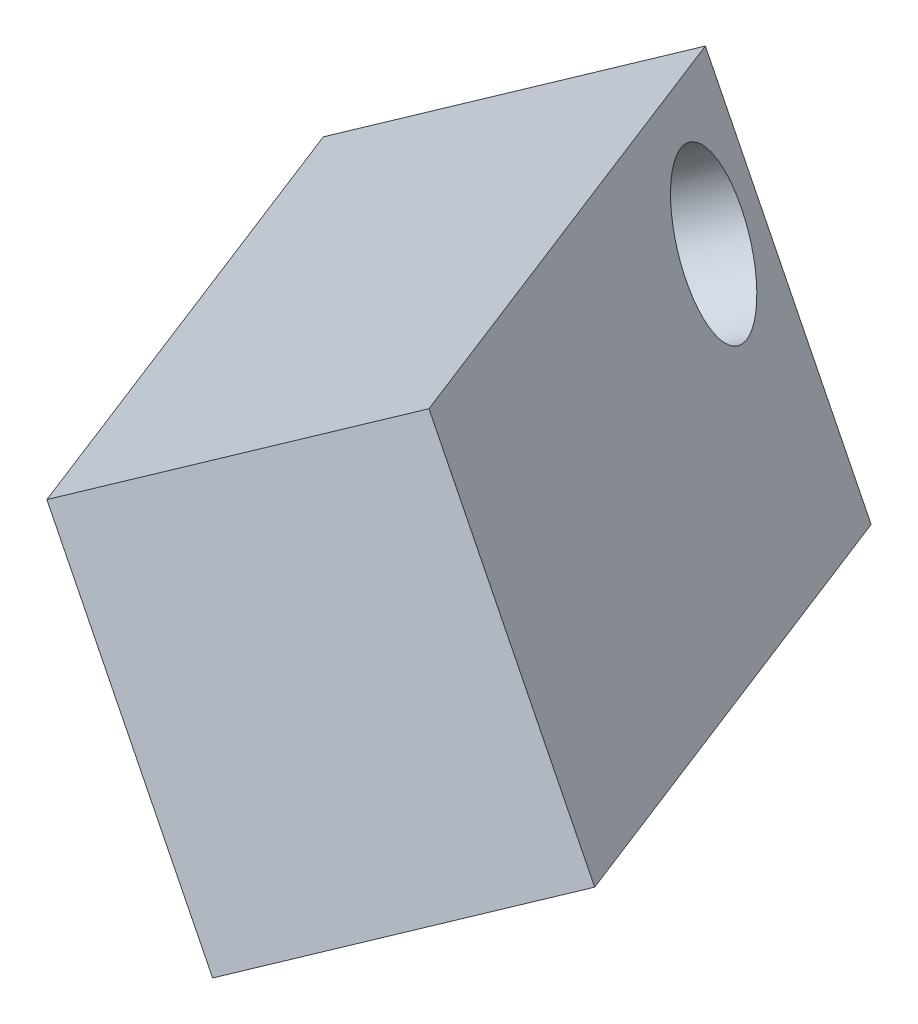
from build123d import *

# Parameters (mm, degrees)
SKIZZE1_W                       = 100
SKIZZE1_H                       = 50
AUFSATZ_LINEAR_AUSTRAGEN1_DEPTH = 40
SKIZZE2_R                       = 10
SCHNITT_LINEAR_AUSTRAGEN1_DEPTH = 40


with BuildPart() as part:
    # Skizze1 → Aufsatz-Linear austragen1 (new body)
    with BuildSketch(Plane(origin=(-300, -150, 210), x_dir=(0.47464445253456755, 0.23732222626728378, 0.8475793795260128), z_dir=(-0.7580980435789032, -0.3790490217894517, 0.5306686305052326))):
        with Locations((100, -75)):
            Rectangle(SKIZZE1_W, SKIZZE1_H)
    extrude(amount=AUFSATZ_LINEAR_AUSTRAGEN1_DEPTH)

    # Skizze2 → Schnitt-Linear austragen1 (cut)
    with BuildSketch(Plane(origin=(-300, -150, 210), x_dir=(-0.47464445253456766, -0.23732222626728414, -0.8475793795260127), z_dir=(0.7580980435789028, 0.37904902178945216, -0.5306686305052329))):
        with Locations(Location((-65, -65, 0), (0, 0, 14.860123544))):
            Circle(SKIZZE2_R)
    extrude(amount=-SCHNITT_LINEAR_AUSTRAGEN1_DEPTH, mode=Mode.SUBTRACT)


solid = part.part
